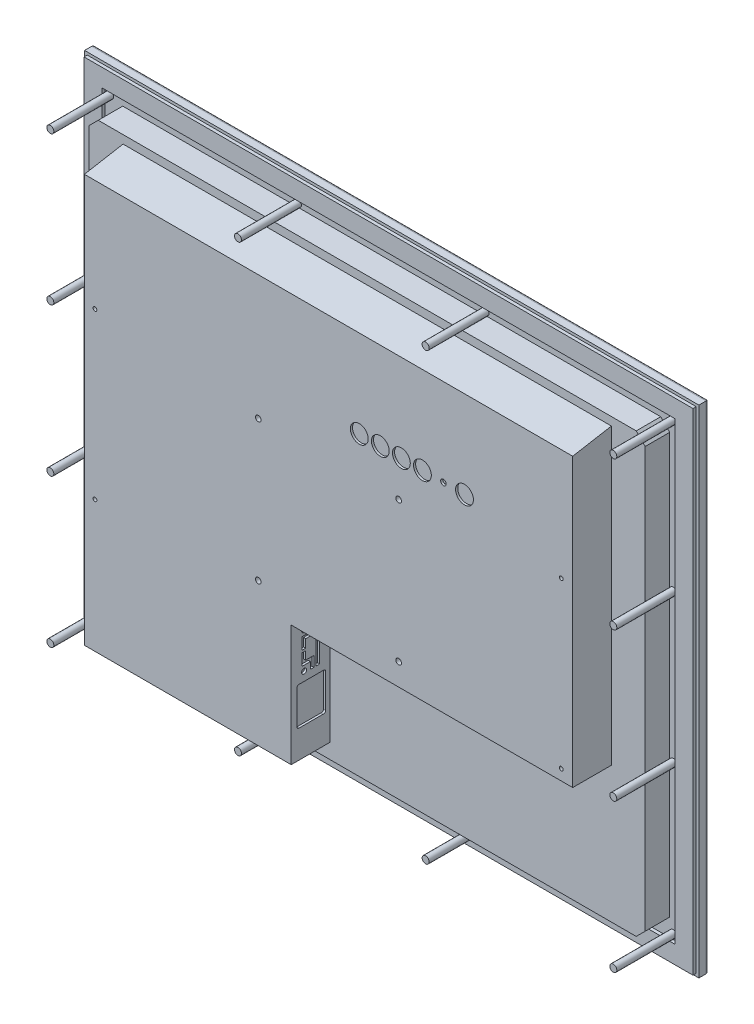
from build123d import *

# Parameters (mm, degrees)
SKETCH1_W                                 = 437.769
SKETCH1_H                                 = 353.568
BEZEL_DEPTH                               = 7.112
BEZEL_RADIUS_R                            = 2
SKETCH2_W                                 = 340.36
SKETCH2_H                                 = 272.796
WINDOW_DEPTH                              = 2.35
SKETCH3_W                                 = 433.959
SKETCH3_H                                 = 349.758
SKETCH3_W_2                               = 408.559
SKETCH3_H_2                               = 324.358
GASKET_DEPTH                              = 2.3
SKETCH5_R                                 = 2.5
PANEL_FRAME_STUDS_DEPTH                   = 42.7
BODY_DEPTH                                = 17.4498
REAR_COVER_DEPTH                          = 27.559
REAR_COVER_SLOPE_ANGLE                    = 10
F_4_0MM_VESA_HOLES_AT_2_COUNT             = 2
F_4_0MM_VESA_HOLES_AT_2_PITCH             = 100
F_4_0MM_VESA_HOLES_AT_3_COUNT             = 2
F_4_0MM_VESA_HOLES_AT_3_PITCH             = 141.421356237
F_4_0MM_VESA_HOLES_AT_4_COUNT             = 2
F_4_0MM_VESA_HOLES_AT_4_PITCH             = 100
SKETCH10_R                                = 1.5875
VIDEO_TOUCH_INTERFACE_DEPTH               = 1.524
SKETCH11_R                                = 1.7907
SKETCH11_W                                = 2.54
SKETCH11_H                                = 27.94
POWER_AC_AND_DC_DEPTH                     = 1.524
SKETCH12_R                                = 6.35
SKETCH12_R_2                              = 1.9812
CONTROLS_BUTTONS_DEPTH                    = 1.524
F_6_32_ACCESSORY_BRACKET_HOLES_AT_2_COUNT = 2
F_6_32_ACCESSORY_BRACKET_HOLES_AT_2_PITCH = 117.5258
F_6_32_ACCESSORY_BRACKET_HOLES_AT_3_COUNT = 2
F_6_32_ACCESSORY_BRACKET_HOLES_AT_3_PITCH = 352.502390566
F_6_32_ACCESSORY_BRACKET_HOLES_AT_4_COUNT = 2
F_6_32_ACCESSORY_BRACKET_HOLES_AT_4_PITCH = 332.3336


with BuildPart() as part:
    # Sketch1 → Bezel (new body)
    with BuildSketch(Plane.XY):
        Rectangle(SKETCH1_W, SKETCH1_H)
    extrude(amount=-BEZEL_DEPTH)

    # Bezel Radius
    bezel_radius_edges = [part.edges().sort_by_distance(p)[0] for p in [
        (218.8845, 0, -7.112),
        (0, 176.784, -7.112),
        (-218.8845, 0, -7.112),
        (0, -176.784, -7.112),
    ]]
    fillet(bezel_radius_edges, radius=BEZEL_RADIUS_R)

    # Sketch2 → Window (cut)
    with BuildSketch(Plane(origin=(0, 0, -7.112), x_dir=(-1, 0, 0), z_dir=(0, 0, -1))):
        Rectangle(SKETCH2_W, SKETCH2_H)
    extrude(amount=-WINDOW_DEPTH, mode=Mode.SUBTRACT)

    # Sketch3 → Gasket (add)
    with BuildSketch(Plane.XY):
        Rectangle(SKETCH3_W, SKETCH3_H)
        Rectangle(SKETCH3_W_2, SKETCH3_H_2, mode=Mode.SUBTRACT)
    extrude(amount=GASKET_DEPTH)

    # Sketch5 → Panel Frame Studs (add)
    with BuildSketch(Plane.XY):
        with Locations(Location((-200.5965, 158.496, 0), (0, 0, 180))):
            Circle(SKETCH5_R)
        with Locations(Location((-200.5965, -158.496, 0), (0, 0, 180))):
            Circle(SKETCH5_R)
        with Locations(Location((-66.8655, 158.496, 0), (0, 0, 180))):
            Circle(SKETCH5_R)
        with Locations(Location((-66.8655, -158.496, 0), (0, 0, 180))):
            Circle(SKETCH5_R)
        with Locations(Location((66.8655, 158.496, 0), (0, 0, 180))):
            Circle(SKETCH5_R)
        with Locations(Location((66.8655, -158.496, 0), (0, 0, 180))):
            Circle(SKETCH5_R)
        with Locations(Location((200.5965, 158.496, 0), (0, 0, 180))):
            Circle(SKETCH5_R)
        with Locations(Location((200.5965, -158.496, 0), (0, 0, 180))):
            Circle(SKETCH5_R)
        with Locations(Location((-200.5965, 52.832, 0), (0, 0, 180))):
            Circle(SKETCH5_R)
        with Locations(Location((200.5965, 52.832, 0), (0, 0, 180))):
            Circle(SKETCH5_R)
        with Locations(Location((-200.5965, -52.832, 0), (0, 0, 180))):
            Circle(SKETCH5_R)
        with Locations(Location((200.5965, -52.832, 0), (0, 0, 180))):
            Circle(SKETCH5_R)
    extrude(amount=PANEL_FRAME_STUDS_DEPTH)


with BuildPart() as body_2:
    # Sketch6 → Body (new body)
    with BuildSketch(Plane.XY):
        Polygon((-198.0965, 149.58409713), (-191.68459713, 155.996), (191.68459713, 155.996), (198.0965, 149.58409713), (198.0965, -149.58409713), (191.68459713, -155.996), (-191.68459713, -155.996), (-198.0965, -149.58409713), align=None)
    extrude(amount=BODY_DEPTH)


with BuildPart() as body_3:
    # Sketch7 → Rear Cover (new body)
    with BuildSketch(Plane.XY.offset(17.4498)):
        Polygon((-173.99, 150.1394), (173.99, 150.1394), (173.99, -59.2074), (-26.6192, -59.2074), (-26.6192, -145.3896), (-173.99, -145.3896), align=None)
    extrude(amount=REAR_COVER_DEPTH)

    # Rear Cover Slope
    rear_cover_slope_faces = [body_3.faces().sort_by_distance(p)[0] for p in [
        (0, 150.1394, 31.2293),
    ]]
    draft(rear_cover_slope_faces, Plane.XY.offset(17.4498), REAR_COVER_SLOPE_ANGLE)

    # Sketch9 → 4.0mm VESA Holes (revolve, cut)
    with BuildSketch(Plane(origin=(-50.0253, 56.5152, 45.0088), x_dir=(0, -1, 0), z_dir=(1, 0, 0))):
        Polygon((0, 0), (0, 17.203721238), (2, 16.002), (2, 0), align=None)
    f_4_0mm_vesa_holes = revolve(axis=Axis((-50.0253, 56.5152, 51.3588), (0, 0, -1)), mode=Mode.SUBTRACT)

    # 4.0mm VESA Holes at 2: 4.0mm VESA Holes ×2
    with Locations(*[(i * F_4_0MM_VESA_HOLES_AT_2_PITCH, 0, 0) for i in range(1, F_4_0MM_VESA_HOLES_AT_2_COUNT)]):
        add(f_4_0mm_vesa_holes, mode=Mode.SUBTRACT)

    # 4.0mm VESA Holes at 3: 4.0mm VESA Holes ×2
    with Locations(*[Vector(0.7071067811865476, -0.7071067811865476, 0) * (i * F_4_0MM_VESA_HOLES_AT_3_PITCH) for i in range(1, F_4_0MM_VESA_HOLES_AT_3_COUNT)]):
        add(f_4_0mm_vesa_holes, mode=Mode.SUBTRACT)

    # 4.0mm VESA Holes at 4: 4.0mm VESA Holes ×2
    with Locations(*[(0, -i * F_4_0MM_VESA_HOLES_AT_4_PITCH, 0) for i in range(1, F_4_0MM_VESA_HOLES_AT_4_COUNT)]):
        add(f_4_0mm_vesa_holes, mode=Mode.SUBTRACT)

    # Sketch10 → Video _ Touch Interface (cut)
    with BuildSketch(Plane(origin=(0, -59.2074, 0), x_dir=(1, 0, 0), z_dir=(0, 1, 0))):
        with Locations((54.068305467, -28.20091993)):
            Circle(SKETCH10_R)
        with Locations((21.556305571, -28.20091993)):
            Circle(SKETCH10_R)
        with Locations((87.982705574, -29.72491993)):
            Circle(SKETCH10_R)
        with Locations((62.982711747, -29.72491993)):
            Circle(SKETCH10_R)
        with Locations((107.652134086, -29.34391993)):
            Circle(SKETCH10_R)
        with Locations((132.652127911, -29.34391993)):
            Circle(SKETCH10_R)
        with BuildLine():
            Line((51.47430861, -30.74091993), (51.47430861, -25.66091993))
            ThreePointArc((51.47430861, -25.66091993), (50.58883367, -23.461215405), (48.426308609, -22.488460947))
            Line((48.426308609, -22.488460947), (27.198302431, -22.488460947))
            ThreePointArc((27.198302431, -22.488460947), (25.03577737, -23.461215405), (24.15030243, -25.66091993))
            Line((24.15030243, -25.66091993), (24.15030243, -30.74091993))
            ThreePointArc((24.15030243, -30.74091993), (25.03577737, -32.940624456), (27.198302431, -33.913378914))
            Line((27.198302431, -33.913378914), (48.426308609, -33.913378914))
            ThreePointArc((48.426308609, -33.913378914), (50.58883367, -32.940624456), (51.47430861, -30.74091993))
        make_face()
        with BuildLine():
            Line((85.642669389, -27.17221993), (85.642669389, -32.25221993))
            ThreePointArc((85.642669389, -32.25221993), (84.757194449, -34.451924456), (82.59466939, -35.424678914))
            Line((82.59466939, -35.424678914), (68.370669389, -35.424678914))
            ThreePointArc((68.370669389, -35.424678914), (66.208144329, -34.451924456), (65.322669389, -32.25221993))
            Line((65.322669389, -32.25221993), (65.322669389, -27.17221993))
            ThreePointArc((65.322669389, -27.17221993), (66.20814433, -24.972515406), (68.370669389, -23.999760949))
            Line((68.370669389, -23.999760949), (82.467097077, -23.997219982))
            ThreePointArc((82.467097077, -23.997219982), (84.712531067, -24.926953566), (85.642669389, -27.17221993))
        make_face()
        with BuildLine():
            Line((109.992091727, -26.816619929), (109.992091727, -31.89661993))
            ThreePointArc((109.992091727, -31.89661993), (110.877566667, -34.096324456), (113.040091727, -35.069078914))
            Line((113.040091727, -35.069078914), (127.136519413, -35.07161988))
            ThreePointArc((127.136519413, -35.07161988), (129.381953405, -34.141886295), (130.312091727, -31.89661993))
            Line((130.312091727, -31.89661993), (130.312091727, -26.81661993))
            ThreePointArc((130.312091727, -26.81661993), (129.426616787, -24.616915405), (127.264091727, -23.644160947))
            Line((127.264091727, -23.644160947), (113.040091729, -23.644160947))
            ThreePointArc((113.040091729, -23.644160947), (110.877566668, -24.616915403), (109.992091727, -26.816619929))
        make_face()
        with BuildLine():
            Line((161.930703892, -23.24791993), (145.928703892, -23.24791993))
            Line((145.928703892, -23.24791993), (145.928703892, -27.75641993))
            Line((145.928703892, -27.75641993), (141.483703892, -27.75641993))
            ThreePointArc((141.483703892, -27.75641993), (139.896203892, -29.34391993), (141.483703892, -30.93141993))
            Line((141.483703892, -30.93141993), (145.928703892, -30.93141993))
            Line((145.928703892, -30.93141993), (145.928703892, -35.43991993))
            Line((145.928703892, -35.43991993), (161.930703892, -35.43991993))
            Line((161.930703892, -35.43991993), (161.930703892, -30.93141993))
            Line((161.930703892, -30.93141993), (166.375703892, -30.93141993))
            ThreePointArc((166.375703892, -30.93141993), (167.963203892, -29.34391993), (166.375703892, -27.75641993))
            Line((166.375703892, -27.75641993), (161.930703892, -27.75641993))
            Line((161.930703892, -27.75641993), (161.930703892, -23.24791993))
        make_face()
    extrude(amount=VIDEO_TOUCH_INTERFACE_DEPTH, mode=Mode.SUBTRACT)

    # Sketch11 → Power AC and DC (cut)
    with BuildSketch(Plane.ZY.offset(26.6192)):
        with Locations(Location((35.814, -92.206196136, 0), (0, 0, 180))):
            Circle(SKETCH11_R)
        with Locations(Location((35.814, -66.628396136, 0), (0, 0, 180))):
            Circle(SKETCH11_R)
        Polygon((31.3182, -93.387296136), (31.3182, -88.573996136), (37.211, -88.573996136), (37.211, -80.179296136), (34.671, -80.179296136), (34.671, -86.033996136), (28.7782, -86.033996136), (28.7782, -93.387296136), align=None)
        with Locations((25.9842, -79.417296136)):
            Rectangle(SKETCH11_W, SKETCH11_H)
        Polygon((28.7782, -65.447296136), (31.3182, -65.447296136), (31.3182, -70.260596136), (37.211, -70.260596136), (37.211, -78.655296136), (34.671, -78.655296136), (34.671, -72.800596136), (28.7782, -72.800596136), align=None)
        with BuildLine():
            Line((20.459943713, -100.11945365), (20.459943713, -124.05895204))
            ThreePointArc((20.459943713, -124.05895204), (20.905759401, -125.136028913), (21.982377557, -125.582951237))
            Line((21.982377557, -125.582951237), (39.433752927, -125.582951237))
            ThreePointArc((39.433752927, -125.582951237), (40.511383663, -125.13658197), (40.957752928, -124.058951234))
            Line((40.957752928, -124.058951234), (40.957752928, -100.119452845))
            ThreePointArc((40.957752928, -100.119452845), (40.51193724, -99.042375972), (39.435319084, -98.59545365))
            Line((39.435319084, -98.59545365), (21.983943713, -98.59545365))
            ThreePointArc((21.983943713, -98.59545365), (20.906312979, -99.041822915), (20.459943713, -100.11945365))
        make_face()
    extrude(amount=POWER_AC_AND_DC_DEPTH, mode=Mode.SUBTRACT)

    # Sketch12 → Controls Buttons (cut)
    with BuildSketch(Plane.XY.offset(45.0088)):
        with Locations((21.888258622, 83.042682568)):
            Circle(SKETCH12_R)
        with Locations((36.888258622, 83.042682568)):
            Circle(SKETCH12_R)
        with Locations((51.888258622, 83.042682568)):
            Circle(SKETCH12_R)
        with Locations((66.888258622, 83.042682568)):
            Circle(SKETCH12_R)
        with Locations((81.888258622, 83.042682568)):
            Circle(SKETCH12_R_2)
        with Locations((96.888258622, 83.042682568)):
            Circle(SKETCH12_R)
    extrude(amount=-CONTROLS_BUTTONS_DEPTH, mode=Mode.SUBTRACT)

    # Sketch14 → 6-32 Accessory Bracket Holes (revolve, cut)
    with BuildSketch(Plane(origin=(-166.4589, -51.5874, 45.0088), x_dir=(0, -1, 0), z_dir=(1, 0, 0))):
        Polygon((0, 0), (0, 16.81469403), (1.35255, 16.002), (1.35255, 0), align=None)
    f_6_32_accessory_bracket_holes = revolve(axis=Axis((-166.4589, -51.5874, 51.3588), (0, 0, -1)), mode=Mode.SUBTRACT)

    # 6-32 Accessory Bracket Holes at 2: 6-32 Accessory Bracket Holes ×2
    with Locations(*[(0, i * F_6_32_ACCESSORY_BRACKET_HOLES_AT_2_PITCH, 0) for i in range(1, F_6_32_ACCESSORY_BRACKET_HOLES_AT_2_COUNT)]):
        add(f_6_32_accessory_bracket_holes, mode=Mode.SUBTRACT)

    # 6-32 Accessory Bracket Holes at 3: 6-32 Accessory Bracket Holes ×2
    with Locations(*[Vector(0.9427839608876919, 0.3334042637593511, 0) * (i * F_6_32_ACCESSORY_BRACKET_HOLES_AT_3_PITCH) for i in range(1, F_6_32_ACCESSORY_BRACKET_HOLES_AT_3_COUNT)]):
        add(f_6_32_accessory_bracket_holes, mode=Mode.SUBTRACT)

    # 6-32 Accessory Bracket Holes at 4: 6-32 Accessory Bracket Holes ×2
    with Locations(*[(i * F_6_32_ACCESSORY_BRACKET_HOLES_AT_4_PITCH, 0, 0) for i in range(1, F_6_32_ACCESSORY_BRACKET_HOLES_AT_4_COUNT)]):
        add(f_6_32_accessory_bracket_holes, mode=Mode.SUBTRACT)


solid = Compound([part.part, body_2.part, body_3.part])
